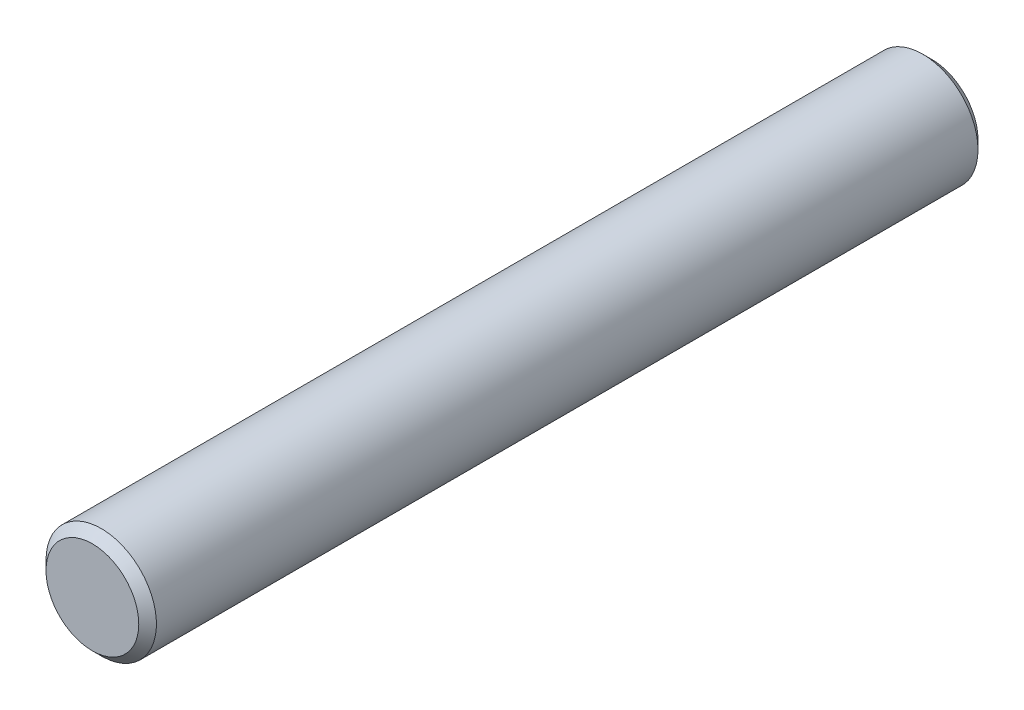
ISO-10303-21;
HEADER;
FILE_DESCRIPTION(('STEP AP214'),'2;1');
FILE_NAME('part.step','',(''),(''),'','','');
FILE_SCHEMA(('AUTOMOTIVE_DESIGN { 1 0 10303 214 1 1 1 1 }'));
ENDSEC;
DATA;
#1=APPLICATION_CONTEXT('core data for automotive mechanical design processes');
#2=APPLICATION_PROTOCOL_DEFINITION('international standard','automotive_design',2000,#1);
#3=PRODUCT_CONTEXT('',#1,'mechanical');
#4=PRODUCT('Part','Part','',(#3));
#5=PRODUCT_RELATED_PRODUCT_CATEGORY('part','',(#4));
#6=PRODUCT_DEFINITION_FORMATION('','',#4);
#7=PRODUCT_DEFINITION_CONTEXT('part definition',#1,'design');
#8=PRODUCT_DEFINITION('design','',#6,#7);
#9=PRODUCT_DEFINITION_SHAPE('','',#8);
#10=(LENGTH_UNIT() NAMED_UNIT(*) SI_UNIT(.MILLI.,.METRE.));
#11=(NAMED_UNIT(*) PLANE_ANGLE_UNIT() SI_UNIT($,.RADIAN.));
#12=(NAMED_UNIT(*) SI_UNIT($,.STERADIAN.) SOLID_ANGLE_UNIT());
#13=UNCERTAINTY_MEASURE_WITH_UNIT(LENGTH_MEASURE(1.E-05),#10,'distance_accuracy_value','');
#14=(GEOMETRIC_REPRESENTATION_CONTEXT(3) GLOBAL_UNCERTAINTY_ASSIGNED_CONTEXT((#13)) GLOBAL_UNIT_ASSIGNED_CONTEXT((#10,
#11,#12)) REPRESENTATION_CONTEXT('',''));
#15=CARTESIAN_POINT('',(0.,0.,0.));
#16=DIRECTION('',(0.,0.,1.));
#17=DIRECTION('',(1.,0.,0.));
#18=AXIS2_PLACEMENT_3D('',#15,#16,#17);
#19=CARTESIAN_POINT('',(0.,0.,24.13));
#20=DIRECTION('',(0.,0.,-1.));
#21=DIRECTION('',(-1.,0.,0.));
#22=AXIS2_PLACEMENT_3D('',#19,#20,#21);
#23=CYLINDRICAL_SURFACE('',#22,1.5875);
#24=CARTESIAN_POINT('',(0.,0.,0.254000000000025));
#25=DIRECTION('',(0.,0.,1.));
#26=DIRECTION('',(1.,0.,0.));
#27=AXIS2_PLACEMENT_3D('',#24,#25,#26);
#28=CIRCLE('',#27,1.5875);
#29=CARTESIAN_POINT('',(-1.5875,0.,0.254000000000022));
#30=VERTEX_POINT('',#29);
#31=EDGE_CURVE('E39',#30,#30,#28,.T.);
#32=CARTESIAN_POINT('',(0.,0.,23.876));
#33=DIRECTION('',(0.,0.,1.));
#34=DIRECTION('',(1.,0.,0.));
#35=AXIS2_PLACEMENT_3D('',#32,#33,#34);
#36=CIRCLE('',#35,1.5875);
#37=CARTESIAN_POINT('',(-1.5875,0.,23.876));
#38=VERTEX_POINT('',#37);
#39=EDGE_CURVE('E43',#38,#38,#36,.F.);
#40=CARTESIAN_POINT('',(-1.5875,0.,0.254000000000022));
#41=CARTESIAN_POINT('',(-1.5875,0.,0.500062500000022));
#42=CARTESIAN_POINT('',(-1.5875,0.,0.746125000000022));
#43=CARTESIAN_POINT('',(-1.5875,0.,1.23825000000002));
#44=CARTESIAN_POINT('',(-1.5875,0.,1.48431250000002));
#45=CARTESIAN_POINT('',(-1.5875,0.,1.97643750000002));
#46=CARTESIAN_POINT('',(-1.5875,0.,2.22250000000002));
#47=CARTESIAN_POINT('',(-1.5875,0.,2.71462500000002));
#48=CARTESIAN_POINT('',(-1.5875,0.,2.96068750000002));
#49=CARTESIAN_POINT('',(-1.5875,0.,3.45281250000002));
#50=CARTESIAN_POINT('',(-1.5875,0.,3.69887500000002));
#51=CARTESIAN_POINT('',(-1.5875,0.,4.19100000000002));
#52=CARTESIAN_POINT('',(-1.5875,0.,4.43706250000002));
#53=CARTESIAN_POINT('',(-1.5875,0.,4.92918750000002));
#54=CARTESIAN_POINT('',(-1.5875,0.,5.17525000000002));
#55=CARTESIAN_POINT('',(-1.5875,0.,5.66737500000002));
#56=CARTESIAN_POINT('',(-1.5875,0.,5.91343750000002));
#57=CARTESIAN_POINT('',(-1.5875,0.,6.40556250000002));
#58=CARTESIAN_POINT('',(-1.5875,0.,6.65162500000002));
#59=CARTESIAN_POINT('',(-1.5875,0.,7.14375000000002));
#60=CARTESIAN_POINT('',(-1.5875,0.,7.38981250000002));
#61=CARTESIAN_POINT('',(-1.5875,0.,7.88193750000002));
#62=CARTESIAN_POINT('',(-1.5875,0.,8.12800000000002));
#63=CARTESIAN_POINT('',(-1.5875,0.,8.62012500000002));
#64=CARTESIAN_POINT('',(-1.5875,0.,8.86618750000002));
#65=CARTESIAN_POINT('',(-1.5875,0.,9.35831250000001));
#66=CARTESIAN_POINT('',(-1.5875,0.,9.60437500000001));
#67=CARTESIAN_POINT('',(-1.5875,0.,10.0965));
#68=CARTESIAN_POINT('',(-1.5875,0.,10.3425625));
#69=CARTESIAN_POINT('',(-1.5875,0.,10.8346875));
#70=CARTESIAN_POINT('',(-1.5875,0.,11.08075));
#71=CARTESIAN_POINT('',(-1.5875,0.,11.572875));
#72=CARTESIAN_POINT('',(-1.5875,0.,11.8189375));
#73=CARTESIAN_POINT('',(-1.5875,0.,12.3110625));
#74=CARTESIAN_POINT('',(-1.5875,0.,12.557125));
#75=CARTESIAN_POINT('',(-1.5875,0.,13.04925));
#76=CARTESIAN_POINT('',(-1.5875,0.,13.2953125));
#77=CARTESIAN_POINT('',(-1.5875,0.,13.7874375));
#78=CARTESIAN_POINT('',(-1.5875,0.,14.0335));
#79=CARTESIAN_POINT('',(-1.5875,0.,14.525625));
#80=CARTESIAN_POINT('',(-1.5875,0.,14.7716875));
#81=CARTESIAN_POINT('',(-1.5875,0.,15.2638125));
#82=CARTESIAN_POINT('',(-1.5875,0.,15.509875));
#83=CARTESIAN_POINT('',(-1.5875,0.,16.002));
#84=CARTESIAN_POINT('',(-1.5875,0.,16.2480625));
#85=CARTESIAN_POINT('',(-1.5875,0.,16.7401875));
#86=CARTESIAN_POINT('',(-1.5875,0.,16.98625));
#87=CARTESIAN_POINT('',(-1.5875,0.,17.478375));
#88=CARTESIAN_POINT('',(-1.5875,0.,17.7244375));
#89=CARTESIAN_POINT('',(-1.5875,0.,18.2165625));
#90=CARTESIAN_POINT('',(-1.5875,0.,18.462625));
#91=CARTESIAN_POINT('',(-1.5875,0.,18.95475));
#92=CARTESIAN_POINT('',(-1.5875,0.,19.2008125));
#93=CARTESIAN_POINT('',(-1.5875,0.,19.6929375));
#94=CARTESIAN_POINT('',(-1.5875,0.,19.939));
#95=CARTESIAN_POINT('',(-1.5875,0.,20.431125));
#96=CARTESIAN_POINT('',(-1.5875,0.,20.6771875));
#97=CARTESIAN_POINT('',(-1.5875,0.,21.1693125));
#98=CARTESIAN_POINT('',(-1.5875,0.,21.415375));
#99=CARTESIAN_POINT('',(-1.5875,0.,21.9075));
#100=CARTESIAN_POINT('',(-1.5875,0.,22.1535625));
#101=CARTESIAN_POINT('',(-1.5875,0.,22.6456875));
#102=CARTESIAN_POINT('',(-1.5875,0.,22.89175));
#103=CARTESIAN_POINT('',(-1.5875,0.,23.383875));
#104=CARTESIAN_POINT('',(-1.5875,0.,23.6299375));
#105=CARTESIAN_POINT('',(-1.5875,0.,23.876));
#106=B_SPLINE_CURVE_WITH_KNOTS('',3,(#40,#41,#42,#43,#44,#45,#46,#47,#48,#49,#50,#51,#52,#53,
#54,#55,#56,#57,#58,#59,#60,#61,#62,#63,#64,#65,#66,#67,#68,#69,#70,#71,#72,#73,#74,#75,#76,#77,
#78,#79,#80,#81,#82,#83,#84,#85,#86,#87,#88,#89,#90,#91,#92,#93,#94,#95,#96,#97,#98,#99,#100,
#101,#102,#103,#104,#105),.UNSPECIFIED.,.F.,.F.,(4,2,2,2,2,2,2,2,2,2,2,2,2,2,2,2,2,2,2,2,2,2,2,
2,2,2,2,2,2,2,2,2,4),(0.,0.738187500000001,1.476375,2.2145625,2.95275,3.6909375,4.429125,
5.1673125,5.9055,6.6436875,7.381875,8.1200625,8.85824999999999,9.59643749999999,10.334625,
11.0728125,11.811,12.5491875,13.287375,14.0255625,14.76375,15.5019375,16.240125,16.9783125,
17.7165,18.4546875,19.192875,19.9310625,20.66925,21.4074375,22.145625,22.8838125,23.622),.UNSPECIFIED.);
#107=EDGE_CURVE('BSEAM28',#30,#38,#106,.T.);
#108=ORIENTED_EDGE('',*,*,#31,.T.);
#109=ORIENTED_EDGE('',*,*,#39,.T.);
#110=ORIENTED_EDGE('',*,*,#107,.T.);
#111=ORIENTED_EDGE('',*,*,#107,.F.);
#112=EDGE_LOOP('',(#108,#110,#109,#111));
#113=FACE_BOUND('',#112,.T.);
#114=ADVANCED_FACE('F28',(#113),#23,.T.);
#115=CARTESIAN_POINT('',(0.,0.,24.13));
#116=DIRECTION('',(0.,0.,1.));
#117=DIRECTION('',(1.,0.,0.));
#118=AXIS2_PLACEMENT_3D('',#115,#116,#117);
#119=PLANE('',#118);
#120=CARTESIAN_POINT('',(0.,0.,24.13));
#121=DIRECTION('',(0.,0.,1.));
#122=DIRECTION('',(1.,0.,0.));
#123=AXIS2_PLACEMENT_3D('',#120,#121,#122);
#124=CIRCLE('',#123,1.33350000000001);
#125=CARTESIAN_POINT('',(1.33350000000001,0.,24.13));
#126=VERTEX_POINT('',#125);
#127=EDGE_CURVE('E10',#126,#126,#124,.T.);
#128=ORIENTED_EDGE('',*,*,#127,.T.);
#129=EDGE_LOOP('',(#128));
#130=FACE_BOUND('',#129,.T.);
#131=ADVANCED_FACE('F59',(#130),#119,.T.);
#132=CARTESIAN_POINT('',(0.,0.,0.));
#133=DIRECTION('',(0.,0.,1.));
#134=DIRECTION('',(1.,0.,0.));
#135=AXIS2_PLACEMENT_3D('',#132,#133,#134);
#136=PLANE('',#135);
#137=CARTESIAN_POINT('',(0.,0.,0.));
#138=DIRECTION('',(0.,0.,1.));
#139=DIRECTION('',(1.,0.,0.));
#140=AXIS2_PLACEMENT_3D('',#137,#138,#139);
#141=CIRCLE('',#140,1.33349999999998);
#142=CARTESIAN_POINT('',(1.33349999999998,0.,0.));
#143=VERTEX_POINT('',#142);
#144=EDGE_CURVE('E35',#143,#143,#141,.F.);
#145=ORIENTED_EDGE('',*,*,#144,.T.);
#146=EDGE_LOOP('',(#145));
#147=FACE_BOUND('',#146,.T.);
#148=ADVANCED_FACE('F56',(#147),#136,.F.);
#149=CARTESIAN_POINT('',(0.,0.,0.254000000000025));
#150=DIRECTION('',(0.,0.,1.));
#151=DIRECTION('',(1.,0.,0.));
#152=AXIS2_PLACEMENT_3D('',#149,#150,#151);
#153=CONICAL_SURFACE('',#152,1.5875,0.785398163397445);
#154=ORIENTED_EDGE('',*,*,#144,.F.);
#155=EDGE_LOOP('',(#154));
#156=FACE_BOUND('',#155,.T.);
#157=ORIENTED_EDGE('',*,*,#31,.F.);
#158=EDGE_LOOP('',(#157));
#159=FACE_BOUND('',#158,.T.);
#160=ADVANCED_FACE('F52',(#156,#159),#153,.T.);
#161=CARTESIAN_POINT('',(0.,0.,24.13));
#162=DIRECTION('',(0.,0.,-1.));
#163=DIRECTION('',(-1.,0.,0.));
#164=AXIS2_PLACEMENT_3D('',#161,#162,#163);
#165=CONICAL_SURFACE('',#164,1.33350000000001,0.785398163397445);
#166=ORIENTED_EDGE('',*,*,#39,.F.);
#167=EDGE_LOOP('',(#166));
#168=FACE_BOUND('',#167,.T.);
#169=ORIENTED_EDGE('',*,*,#127,.F.);
#170=EDGE_LOOP('',(#169));
#171=FACE_BOUND('',#170,.T.);
#172=ADVANCED_FACE('F30',(#168,#171),#165,.T.);
#173=CLOSED_SHELL('',(#114,#131,#148,#160,#172));
#174=MANIFOLD_SOLID_BREP('B2',#173);
#175=ADVANCED_BREP_SHAPE_REPRESENTATION('',(#18,#174),#14);
#176=SHAPE_DEFINITION_REPRESENTATION(#9,#175);
ENDSEC;
END-ISO-10303-21;
